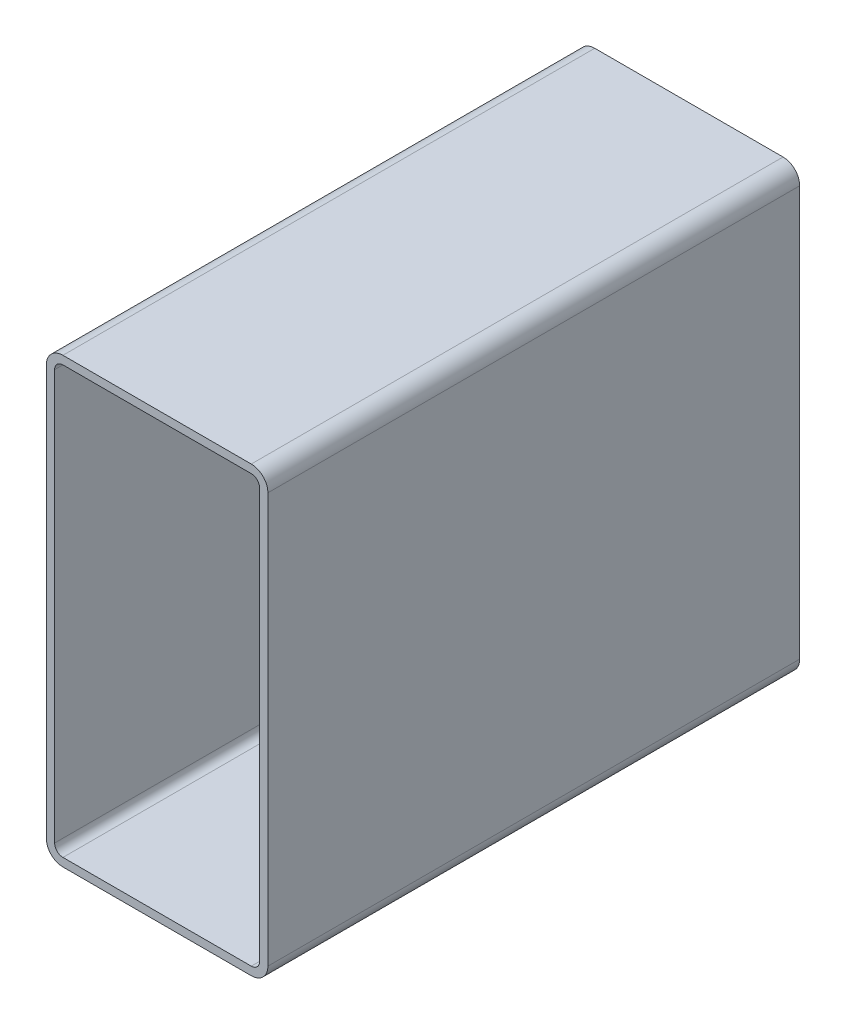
ISO-10303-21;
HEADER;
FILE_DESCRIPTION(('STEP AP214'),'2;1');
FILE_NAME('part.step','',(''),(''),'','','');
FILE_SCHEMA(('AUTOMOTIVE_DESIGN { 1 0 10303 214 1 1 1 1 }'));
ENDSEC;
DATA;
#1=APPLICATION_CONTEXT('core data for automotive mechanical design processes');
#2=APPLICATION_PROTOCOL_DEFINITION('international standard','automotive_design',2000,#1);
#3=PRODUCT_CONTEXT('',#1,'mechanical');
#4=PRODUCT('Part','Part','',(#3));
#5=PRODUCT_RELATED_PRODUCT_CATEGORY('part','',(#4));
#6=PRODUCT_DEFINITION_FORMATION('','',#4);
#7=PRODUCT_DEFINITION_CONTEXT('part definition',#1,'design');
#8=PRODUCT_DEFINITION('design','',#6,#7);
#9=PRODUCT_DEFINITION_SHAPE('','',#8);
#10=(LENGTH_UNIT() NAMED_UNIT(*) SI_UNIT(.MILLI.,.METRE.));
#11=(NAMED_UNIT(*) PLANE_ANGLE_UNIT() SI_UNIT($,.RADIAN.));
#12=(NAMED_UNIT(*) SI_UNIT($,.STERADIAN.) SOLID_ANGLE_UNIT());
#13=UNCERTAINTY_MEASURE_WITH_UNIT(LENGTH_MEASURE(1.E-05),#10,'distance_accuracy_value','');
#14=(GEOMETRIC_REPRESENTATION_CONTEXT(3) GLOBAL_UNCERTAINTY_ASSIGNED_CONTEXT((#13)) GLOBAL_UNIT_ASSIGNED_CONTEXT((#10,
#11,#12)) REPRESENTATION_CONTEXT('',''));
#15=CARTESIAN_POINT('',(0.,0.,0.));
#16=DIRECTION('',(0.,0.,1.));
#17=DIRECTION('',(1.,0.,0.));
#18=AXIS2_PLACEMENT_3D('',#15,#16,#17);
#19=CARTESIAN_POINT('',(10.3862396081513,246.395313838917,304.8));
#20=DIRECTION('',(0.,0.,1.));
#21=DIRECTION('',(1.,0.,0.));
#22=AXIS2_PLACEMENT_3D('',#19,#20,#21);
#23=PLANE('',#22);
#24=CARTESIAN_POINT('',(10.3862396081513,246.395313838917,304.8));
#25=DIRECTION('',(0.,0.,1.));
#26=DIRECTION('',(1.,0.,0.));
#27=AXIS2_PLACEMENT_3D('',#24,#25,#26);
#28=CIRCLE('',#27,9.52500000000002);
#29=CARTESIAN_POINT('',(10.3862396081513,255.920313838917,304.8));
#30=VERTEX_POINT('',#29);
#31=CARTESIAN_POINT('',(0.8612396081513,246.395313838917,304.8));
#32=VERTEX_POINT('',#31);
#33=EDGE_CURVE('E211',#30,#32,#28,.T.);
#34=ORIENTED_EDGE('',*,*,#33,.T.);
#35=DIRECTION('',(0.,-1.,0.));
#36=VECTOR('',#35,1.);
#37=CARTESIAN_POINT('',(0.8612396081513,11.4453138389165,304.8));
#38=LINE('',#37,#36);
#39=CARTESIAN_POINT('',(0.861239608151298,11.4453138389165,304.8));
#40=VERTEX_POINT('',#39);
#41=EDGE_CURVE('E214',#32,#40,#38,.T.);
#42=ORIENTED_EDGE('',*,*,#41,.T.);
#43=CARTESIAN_POINT('',(10.3862396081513,11.4453138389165,304.8));
#44=DIRECTION('',(0.,0.,1.));
#45=DIRECTION('',(1.,0.,0.));
#46=AXIS2_PLACEMENT_3D('',#43,#44,#45);
#47=CIRCLE('',#46,9.525);
#48=CARTESIAN_POINT('',(10.3862396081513,1.92031383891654,304.8));
#49=VERTEX_POINT('',#48);
#50=EDGE_CURVE('E217',#40,#49,#47,.T.);
#51=ORIENTED_EDGE('',*,*,#50,.T.);
#52=DIRECTION('',(1.,0.,0.));
#53=VECTOR('',#52,1.);
#54=CARTESIAN_POINT('',(118.336239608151,1.92031383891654,304.8));
#55=LINE('',#54,#53);
#56=CARTESIAN_POINT('',(118.336239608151,1.92031383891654,304.8));
#57=VERTEX_POINT('',#56);
#58=EDGE_CURVE('E219',#49,#57,#55,.T.);
#59=ORIENTED_EDGE('',*,*,#58,.T.);
#60=CARTESIAN_POINT('',(118.336239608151,11.4453138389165,304.8));
#61=DIRECTION('',(0.,0.,1.));
#62=DIRECTION('',(1.,0.,0.));
#63=AXIS2_PLACEMENT_3D('',#60,#61,#62);
#64=CIRCLE('',#63,9.525);
#65=CARTESIAN_POINT('',(127.861239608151,11.4453138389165,304.8));
#66=VERTEX_POINT('',#65);
#67=EDGE_CURVE('E221',#57,#66,#64,.T.);
#68=ORIENTED_EDGE('',*,*,#67,.T.);
#69=DIRECTION('',(0.,1.,0.));
#70=VECTOR('',#69,1.);
#71=CARTESIAN_POINT('',(127.861239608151,246.395313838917,304.8));
#72=LINE('',#71,#70);
#73=CARTESIAN_POINT('',(127.861239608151,246.395313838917,304.8));
#74=VERTEX_POINT('',#73);
#75=EDGE_CURVE('E223',#66,#74,#72,.T.);
#76=ORIENTED_EDGE('',*,*,#75,.T.);
#77=CARTESIAN_POINT('',(118.336239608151,246.395313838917,304.8));
#78=DIRECTION('',(0.,0.,1.));
#79=DIRECTION('',(1.,0.,0.));
#80=AXIS2_PLACEMENT_3D('',#77,#78,#79);
#81=CIRCLE('',#80,9.52500000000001);
#82=CARTESIAN_POINT('',(118.336239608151,255.920313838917,304.8));
#83=VERTEX_POINT('',#82);
#84=EDGE_CURVE('E225',#74,#83,#81,.T.);
#85=ORIENTED_EDGE('',*,*,#84,.T.);
#86=DIRECTION('',(-1.,0.,0.));
#87=VECTOR('',#86,1.);
#88=CARTESIAN_POINT('',(10.3862396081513,255.920313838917,304.8));
#89=LINE('',#88,#87);
#90=EDGE_CURVE('E227',#83,#30,#89,.T.);
#91=ORIENTED_EDGE('',*,*,#90,.T.);
#92=EDGE_LOOP('',(#34,#42,#51,#59,#68,#76,#85,#91));
#93=FACE_BOUND('',#92,.T.);
#94=DIRECTION('',(0.,-1.,0.));
#95=VECTOR('',#94,1.);
#96=CARTESIAN_POINT('',(5.6237396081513,11.4453138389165,304.8));
#97=LINE('',#96,#95);
#98=CARTESIAN_POINT('',(5.6237396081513,246.395313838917,304.8));
#99=VERTEX_POINT('',#98);
#100=CARTESIAN_POINT('',(5.6237396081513,11.4453138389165,304.8));
#101=VERTEX_POINT('',#100);
#102=EDGE_CURVE('E154',#99,#101,#97,.T.);
#103=ORIENTED_EDGE('',*,*,#102,.F.);
#104=CARTESIAN_POINT('',(10.3862396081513,246.395313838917,304.8));
#105=DIRECTION('',(0.,0.,1.));
#106=DIRECTION('',(1.,0.,0.));
#107=AXIS2_PLACEMENT_3D('',#104,#105,#106);
#108=CIRCLE('',#107,4.76250000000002);
#109=CARTESIAN_POINT('',(10.3862396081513,251.157813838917,304.8));
#110=VERTEX_POINT('',#109);
#111=EDGE_CURVE('E146',#110,#99,#108,.T.);
#112=ORIENTED_EDGE('',*,*,#111,.F.);
#113=DIRECTION('',(-1.,0.,0.));
#114=VECTOR('',#113,1.);
#115=CARTESIAN_POINT('',(10.3862396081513,251.157813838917,304.8));
#116=LINE('',#115,#114);
#117=CARTESIAN_POINT('',(118.336239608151,251.157813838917,304.8));
#118=VERTEX_POINT('',#117);
#119=EDGE_CURVE('E179',#118,#110,#116,.T.);
#120=ORIENTED_EDGE('',*,*,#119,.F.);
#121=CARTESIAN_POINT('',(118.336239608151,246.395313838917,304.8));
#122=DIRECTION('',(0.,0.,1.));
#123=DIRECTION('',(1.,0.,0.));
#124=AXIS2_PLACEMENT_3D('',#121,#122,#123);
#125=CIRCLE('',#124,4.76250000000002);
#126=CARTESIAN_POINT('',(123.098739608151,246.395313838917,304.8));
#127=VERTEX_POINT('',#126);
#128=EDGE_CURVE('E177',#127,#118,#125,.T.);
#129=ORIENTED_EDGE('',*,*,#128,.F.);
#130=DIRECTION('',(0.,1.,0.));
#131=VECTOR('',#130,1.);
#132=CARTESIAN_POINT('',(123.098739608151,246.395313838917,304.8));
#133=LINE('',#132,#131);
#134=CARTESIAN_POINT('',(123.098739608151,11.4453138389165,304.8));
#135=VERTEX_POINT('',#134);
#136=EDGE_CURVE('E175',#135,#127,#133,.T.);
#137=ORIENTED_EDGE('',*,*,#136,.F.);
#138=CARTESIAN_POINT('',(118.336239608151,11.4453138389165,304.8));
#139=DIRECTION('',(0.,0.,1.));
#140=DIRECTION('',(1.,0.,0.));
#141=AXIS2_PLACEMENT_3D('',#138,#139,#140);
#142=CIRCLE('',#141,4.7625);
#143=CARTESIAN_POINT('',(118.336239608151,6.68281383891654,304.8));
#144=VERTEX_POINT('',#143);
#145=EDGE_CURVE('E173',#144,#135,#142,.T.);
#146=ORIENTED_EDGE('',*,*,#145,.F.);
#147=DIRECTION('',(1.,0.,0.));
#148=VECTOR('',#147,1.);
#149=CARTESIAN_POINT('',(118.336239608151,6.68281383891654,304.8));
#150=LINE('',#149,#148);
#151=CARTESIAN_POINT('',(10.3862396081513,6.68281383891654,304.8));
#152=VERTEX_POINT('',#151);
#153=EDGE_CURVE('E169',#152,#144,#150,.T.);
#154=ORIENTED_EDGE('',*,*,#153,.F.);
#155=CARTESIAN_POINT('',(10.3862396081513,11.4453138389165,304.8));
#156=DIRECTION('',(0.,0.,1.));
#157=DIRECTION('',(1.,0.,0.));
#158=AXIS2_PLACEMENT_3D('',#155,#156,#157);
#159=CIRCLE('',#158,4.7625);
#160=EDGE_CURVE('E167',#101,#152,#159,.T.);
#161=ORIENTED_EDGE('',*,*,#160,.F.);
#162=EDGE_LOOP('',(#103,#112,#120,#129,#137,#146,#154,#161));
#163=FACE_BOUND('',#162,.T.);
#164=ADVANCED_FACE('F33',(#93,#163),#23,.T.);
#165=CARTESIAN_POINT('',(10.3862396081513,246.395313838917,0.));
#166=DIRECTION('',(0.,0.,1.));
#167=DIRECTION('',(1.,0.,0.));
#168=AXIS2_PLACEMENT_3D('',#165,#166,#167);
#169=PLANE('',#168);
#170=CARTESIAN_POINT('',(10.3862396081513,246.395313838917,0.));
#171=DIRECTION('',(0.,0.,1.));
#172=DIRECTION('',(1.,0.,0.));
#173=AXIS2_PLACEMENT_3D('',#170,#171,#172);
#174=CIRCLE('',#173,9.52500000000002);
#175=CARTESIAN_POINT('',(10.3862396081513,255.920313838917,0.));
#176=VERTEX_POINT('',#175);
#177=CARTESIAN_POINT('',(0.8612396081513,246.395313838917,0.));
#178=VERTEX_POINT('',#177);
#179=EDGE_CURVE('E162',#176,#178,#174,.T.);
#180=ORIENTED_EDGE('',*,*,#179,.F.);
#181=DIRECTION('',(-1.,0.,0.));
#182=VECTOR('',#181,1.);
#183=CARTESIAN_POINT('',(10.3862396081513,255.920313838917,0.));
#184=LINE('',#183,#182);
#185=CARTESIAN_POINT('',(118.336239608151,255.920313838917,0.));
#186=VERTEX_POINT('',#185);
#187=EDGE_CURVE('E215',#186,#176,#184,.T.);
#188=ORIENTED_EDGE('',*,*,#187,.F.);
#189=CARTESIAN_POINT('',(118.336239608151,246.395313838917,0.));
#190=DIRECTION('',(0.,0.,1.));
#191=DIRECTION('',(1.,0.,0.));
#192=AXIS2_PLACEMENT_3D('',#189,#190,#191);
#193=CIRCLE('',#192,9.52500000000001);
#194=CARTESIAN_POINT('',(127.861239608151,246.395313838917,0.));
#195=VERTEX_POINT('',#194);
#196=EDGE_CURVE('E242',#195,#186,#193,.T.);
#197=ORIENTED_EDGE('',*,*,#196,.F.);
#198=DIRECTION('',(0.,1.,0.));
#199=VECTOR('',#198,1.);
#200=CARTESIAN_POINT('',(127.861239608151,246.395313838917,0.));
#201=LINE('',#200,#199);
#202=CARTESIAN_POINT('',(127.861239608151,11.4453138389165,0.));
#203=VERTEX_POINT('',#202);
#204=EDGE_CURVE('E240',#203,#195,#201,.T.);
#205=ORIENTED_EDGE('',*,*,#204,.F.);
#206=CARTESIAN_POINT('',(118.336239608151,11.4453138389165,0.));
#207=DIRECTION('',(0.,0.,1.));
#208=DIRECTION('',(1.,0.,0.));
#209=AXIS2_PLACEMENT_3D('',#206,#207,#208);
#210=CIRCLE('',#209,9.525);
#211=CARTESIAN_POINT('',(118.336239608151,1.92031383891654,0.));
#212=VERTEX_POINT('',#211);
#213=EDGE_CURVE('E238',#212,#203,#210,.T.);
#214=ORIENTED_EDGE('',*,*,#213,.F.);
#215=DIRECTION('',(1.,0.,0.));
#216=VECTOR('',#215,1.);
#217=CARTESIAN_POINT('',(118.336239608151,1.92031383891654,0.));
#218=LINE('',#217,#216);
#219=CARTESIAN_POINT('',(10.3862396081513,1.92031383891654,0.));
#220=VERTEX_POINT('',#219);
#221=EDGE_CURVE('E236',#220,#212,#218,.T.);
#222=ORIENTED_EDGE('',*,*,#221,.F.);
#223=CARTESIAN_POINT('',(10.3862396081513,11.4453138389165,0.));
#224=DIRECTION('',(0.,0.,1.));
#225=DIRECTION('',(1.,0.,0.));
#226=AXIS2_PLACEMENT_3D('',#223,#224,#225);
#227=CIRCLE('',#226,9.525);
#228=CARTESIAN_POINT('',(0.861239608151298,11.4453138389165,0.));
#229=VERTEX_POINT('',#228);
#230=EDGE_CURVE('E234',#229,#220,#227,.T.);
#231=ORIENTED_EDGE('',*,*,#230,.F.);
#232=DIRECTION('',(0.,-1.,0.));
#233=VECTOR('',#232,1.);
#234=CARTESIAN_POINT('',(0.8612396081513,11.4453138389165,0.));
#235=LINE('',#234,#233);
#236=EDGE_CURVE('E232',#178,#229,#235,.T.);
#237=ORIENTED_EDGE('',*,*,#236,.F.);
#238=EDGE_LOOP('',(#180,#188,#197,#205,#214,#222,#231,#237));
#239=FACE_BOUND('',#238,.T.);
#240=CARTESIAN_POINT('',(10.3862396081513,246.395313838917,0.));
#241=DIRECTION('',(0.,0.,1.));
#242=DIRECTION('',(1.,0.,0.));
#243=AXIS2_PLACEMENT_3D('',#240,#241,#242);
#244=CIRCLE('',#243,4.76250000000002);
#245=CARTESIAN_POINT('',(10.3862396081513,251.157813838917,0.));
#246=VERTEX_POINT('',#245);
#247=CARTESIAN_POINT('',(5.6237396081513,246.395313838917,0.));
#248=VERTEX_POINT('',#247);
#249=EDGE_CURVE('E56',#246,#248,#244,.T.);
#250=ORIENTED_EDGE('',*,*,#249,.T.);
#251=DIRECTION('',(0.,-1.,0.));
#252=VECTOR('',#251,1.);
#253=CARTESIAN_POINT('',(5.6237396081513,11.4453138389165,0.));
#254=LINE('',#253,#252);
#255=CARTESIAN_POINT('',(5.6237396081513,11.4453138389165,0.));
#256=VERTEX_POINT('',#255);
#257=EDGE_CURVE('E161',#248,#256,#254,.T.);
#258=ORIENTED_EDGE('',*,*,#257,.T.);
#259=CARTESIAN_POINT('',(10.3862396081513,11.4453138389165,0.));
#260=DIRECTION('',(0.,0.,1.));
#261=DIRECTION('',(1.,0.,0.));
#262=AXIS2_PLACEMENT_3D('',#259,#260,#261);
#263=CIRCLE('',#262,4.7625);
#264=CARTESIAN_POINT('',(10.3862396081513,6.68281383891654,0.));
#265=VERTEX_POINT('',#264);
#266=EDGE_CURVE('E183',#256,#265,#263,.T.);
#267=ORIENTED_EDGE('',*,*,#266,.T.);
#268=DIRECTION('',(1.,0.,0.));
#269=VECTOR('',#268,1.);
#270=CARTESIAN_POINT('',(118.336239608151,6.68281383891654,0.));
#271=LINE('',#270,#269);
#272=CARTESIAN_POINT('',(118.336239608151,6.68281383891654,0.));
#273=VERTEX_POINT('',#272);
#274=EDGE_CURVE('E186',#265,#273,#271,.T.);
#275=ORIENTED_EDGE('',*,*,#274,.T.);
#276=CARTESIAN_POINT('',(118.336239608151,11.4453138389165,0.));
#277=DIRECTION('',(0.,0.,1.));
#278=DIRECTION('',(1.,0.,0.));
#279=AXIS2_PLACEMENT_3D('',#276,#277,#278);
#280=CIRCLE('',#279,4.7625);
#281=CARTESIAN_POINT('',(123.098739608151,11.4453138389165,0.));
#282=VERTEX_POINT('',#281);
#283=EDGE_CURVE('E189',#273,#282,#280,.T.);
#284=ORIENTED_EDGE('',*,*,#283,.T.);
#285=DIRECTION('',(0.,1.,0.));
#286=VECTOR('',#285,1.);
#287=CARTESIAN_POINT('',(123.098739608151,246.395313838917,0.));
#288=LINE('',#287,#286);
#289=CARTESIAN_POINT('',(123.098739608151,246.395313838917,0.));
#290=VERTEX_POINT('',#289);
#291=EDGE_CURVE('E192',#282,#290,#288,.T.);
#292=ORIENTED_EDGE('',*,*,#291,.T.);
#293=CARTESIAN_POINT('',(118.336239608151,246.395313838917,0.));
#294=DIRECTION('',(0.,0.,1.));
#295=DIRECTION('',(1.,0.,0.));
#296=AXIS2_PLACEMENT_3D('',#293,#294,#295);
#297=CIRCLE('',#296,4.76250000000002);
#298=CARTESIAN_POINT('',(118.336239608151,251.157813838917,0.));
#299=VERTEX_POINT('',#298);
#300=EDGE_CURVE('E195',#290,#299,#297,.T.);
#301=ORIENTED_EDGE('',*,*,#300,.T.);
#302=DIRECTION('',(-1.,0.,0.));
#303=VECTOR('',#302,1.);
#304=CARTESIAN_POINT('',(10.3862396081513,251.157813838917,0.));
#305=LINE('',#304,#303);
#306=EDGE_CURVE('E155',#299,#246,#305,.T.);
#307=ORIENTED_EDGE('',*,*,#306,.T.);
#308=EDGE_LOOP('',(#250,#258,#267,#275,#284,#292,#301,#307));
#309=FACE_BOUND('',#308,.T.);
#310=ADVANCED_FACE('F272',(#239,#309),#169,.F.);
#311=CARTESIAN_POINT('',(10.3862396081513,246.395313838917,304.8));
#312=DIRECTION('',(0.,0.,-1.));
#313=DIRECTION('',(-1.,0.,0.));
#314=AXIS2_PLACEMENT_3D('',#311,#312,#313);
#315=CYLINDRICAL_SURFACE('',#314,9.52500000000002);
#316=ORIENTED_EDGE('',*,*,#179,.T.);
#317=DIRECTION('',(0.,0.,-1.));
#318=VECTOR('',#317,1.);
#319=CARTESIAN_POINT('',(0.8612396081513,246.395313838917,304.8));
#320=LINE('',#319,#318);
#321=EDGE_CURVE('E11',#32,#178,#320,.T.);
#322=ORIENTED_EDGE('',*,*,#321,.F.);
#323=ORIENTED_EDGE('',*,*,#33,.F.);
#324=DIRECTION('',(0.,0.,-1.));
#325=VECTOR('',#324,1.);
#326=CARTESIAN_POINT('',(10.3862396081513,255.920313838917,304.8));
#327=LINE('',#326,#325);
#328=EDGE_CURVE('E229',#30,#176,#327,.T.);
#329=ORIENTED_EDGE('',*,*,#328,.T.);
#330=EDGE_LOOP('',(#316,#322,#323,#329));
#331=FACE_BOUND('',#330,.T.);
#332=ADVANCED_FACE('F35',(#331),#315,.T.);
#333=CARTESIAN_POINT('',(0.8612396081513,11.4453138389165,304.8));
#334=DIRECTION('',(1.,0.,0.));
#335=DIRECTION('',(0.,0.,-1.));
#336=AXIS2_PLACEMENT_3D('',#333,#334,#335);
#337=PLANE('',#336);
#338=ORIENTED_EDGE('',*,*,#236,.T.);
#339=DIRECTION('',(0.,0.,-1.));
#340=VECTOR('',#339,1.);
#341=CARTESIAN_POINT('',(0.861239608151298,11.4453138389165,304.8));
#342=LINE('',#341,#340);
#343=EDGE_CURVE('E41',#40,#229,#342,.T.);
#344=ORIENTED_EDGE('',*,*,#343,.F.);
#345=ORIENTED_EDGE('',*,*,#41,.F.);
#346=ORIENTED_EDGE('',*,*,#321,.T.);
#347=EDGE_LOOP('',(#338,#344,#345,#346));
#348=FACE_BOUND('',#347,.T.);
#349=ADVANCED_FACE('F289',(#348),#337,.F.);
#350=CARTESIAN_POINT('',(10.3862396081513,11.4453138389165,304.8));
#351=DIRECTION('',(0.,0.,-1.));
#352=DIRECTION('',(-1.,0.,0.));
#353=AXIS2_PLACEMENT_3D('',#350,#351,#352);
#354=CYLINDRICAL_SURFACE('',#353,9.525);
#355=ORIENTED_EDGE('',*,*,#230,.T.);
#356=DIRECTION('',(0.,0.,-1.));
#357=VECTOR('',#356,1.);
#358=CARTESIAN_POINT('',(10.3862396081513,1.92031383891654,304.8));
#359=LINE('',#358,#357);
#360=EDGE_CURVE('E259',#49,#220,#359,.T.);
#361=ORIENTED_EDGE('',*,*,#360,.F.);
#362=ORIENTED_EDGE('',*,*,#50,.F.);
#363=ORIENTED_EDGE('',*,*,#343,.T.);
#364=EDGE_LOOP('',(#355,#361,#362,#363));
#365=FACE_BOUND('',#364,.T.);
#366=ADVANCED_FACE('F266',(#365),#354,.T.);
#367=CARTESIAN_POINT('',(118.336239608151,1.92031383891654,304.8));
#368=DIRECTION('',(0.,1.,0.));
#369=DIRECTION('',(0.,0.,1.));
#370=AXIS2_PLACEMENT_3D('',#367,#368,#369);
#371=PLANE('',#370);
#372=ORIENTED_EDGE('',*,*,#221,.T.);
#373=DIRECTION('',(0.,0.,-1.));
#374=VECTOR('',#373,1.);
#375=CARTESIAN_POINT('',(118.336239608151,1.92031383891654,304.8));
#376=LINE('',#375,#374);
#377=EDGE_CURVE('E256',#57,#212,#376,.T.);
#378=ORIENTED_EDGE('',*,*,#377,.F.);
#379=ORIENTED_EDGE('',*,*,#58,.F.);
#380=ORIENTED_EDGE('',*,*,#360,.T.);
#381=EDGE_LOOP('',(#372,#378,#379,#380));
#382=FACE_BOUND('',#381,.T.);
#383=ADVANCED_FACE('F278',(#382),#371,.F.);
#384=CARTESIAN_POINT('',(118.336239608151,11.4453138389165,304.8));
#385=DIRECTION('',(0.,0.,-1.));
#386=DIRECTION('',(-1.,0.,0.));
#387=AXIS2_PLACEMENT_3D('',#384,#385,#386);
#388=CYLINDRICAL_SURFACE('',#387,9.525);
#389=ORIENTED_EDGE('',*,*,#213,.T.);
#390=DIRECTION('',(0.,0.,-1.));
#391=VECTOR('',#390,1.);
#392=CARTESIAN_POINT('',(127.861239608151,11.4453138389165,304.8));
#393=LINE('',#392,#391);
#394=EDGE_CURVE('E253',#66,#203,#393,.T.);
#395=ORIENTED_EDGE('',*,*,#394,.F.);
#396=ORIENTED_EDGE('',*,*,#67,.F.);
#397=ORIENTED_EDGE('',*,*,#377,.T.);
#398=EDGE_LOOP('',(#389,#395,#396,#397));
#399=FACE_BOUND('',#398,.T.);
#400=ADVANCED_FACE('F282',(#399),#388,.T.);
#401=CARTESIAN_POINT('',(127.861239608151,246.395313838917,304.8));
#402=DIRECTION('',(-1.,0.,0.));
#403=DIRECTION('',(0.,0.,1.));
#404=AXIS2_PLACEMENT_3D('',#401,#402,#403);
#405=PLANE('',#404);
#406=ORIENTED_EDGE('',*,*,#204,.T.);
#407=DIRECTION('',(0.,0.,-1.));
#408=VECTOR('',#407,1.);
#409=CARTESIAN_POINT('',(127.861239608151,246.395313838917,304.8));
#410=LINE('',#409,#408);
#411=EDGE_CURVE('E250',#74,#195,#410,.T.);
#412=ORIENTED_EDGE('',*,*,#411,.F.);
#413=ORIENTED_EDGE('',*,*,#75,.F.);
#414=ORIENTED_EDGE('',*,*,#394,.T.);
#415=EDGE_LOOP('',(#406,#412,#413,#414));
#416=FACE_BOUND('',#415,.T.);
#417=ADVANCED_FACE('F302',(#416),#405,.F.);
#418=CARTESIAN_POINT('',(118.336239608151,246.395313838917,304.8));
#419=DIRECTION('',(0.,0.,-1.));
#420=DIRECTION('',(-1.,0.,0.));
#421=AXIS2_PLACEMENT_3D('',#418,#419,#420);
#422=CYLINDRICAL_SURFACE('',#421,9.52500000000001);
#423=ORIENTED_EDGE('',*,*,#196,.T.);
#424=DIRECTION('',(0.,0.,-1.));
#425=VECTOR('',#424,1.);
#426=CARTESIAN_POINT('',(118.336239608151,255.920313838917,304.8));
#427=LINE('',#426,#425);
#428=EDGE_CURVE('E247',#83,#186,#427,.T.);
#429=ORIENTED_EDGE('',*,*,#428,.F.);
#430=ORIENTED_EDGE('',*,*,#84,.F.);
#431=ORIENTED_EDGE('',*,*,#411,.T.);
#432=EDGE_LOOP('',(#423,#429,#430,#431));
#433=FACE_BOUND('',#432,.T.);
#434=ADVANCED_FACE('F300',(#433),#422,.T.);
#435=CARTESIAN_POINT('',(10.3862396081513,255.920313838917,304.8));
#436=DIRECTION('',(0.,-1.,0.));
#437=DIRECTION('',(0.,0.,-1.));
#438=AXIS2_PLACEMENT_3D('',#435,#436,#437);
#439=PLANE('',#438);
#440=ORIENTED_EDGE('',*,*,#187,.T.);
#441=ORIENTED_EDGE('',*,*,#328,.F.);
#442=ORIENTED_EDGE('',*,*,#90,.F.);
#443=ORIENTED_EDGE('',*,*,#428,.T.);
#444=EDGE_LOOP('',(#440,#441,#442,#443));
#445=FACE_BOUND('',#444,.T.);
#446=ADVANCED_FACE('F295',(#445),#439,.F.);
#447=CARTESIAN_POINT('',(10.3862396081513,246.395313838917,304.8));
#448=DIRECTION('',(0.,0.,-1.));
#449=DIRECTION('',(-1.,0.,0.));
#450=AXIS2_PLACEMENT_3D('',#447,#448,#449);
#451=CYLINDRICAL_SURFACE('',#450,4.76250000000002);
#452=ORIENTED_EDGE('',*,*,#249,.F.);
#453=DIRECTION('',(0.,0.,-1.));
#454=VECTOR('',#453,1.);
#455=CARTESIAN_POINT('',(10.3862396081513,251.157813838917,304.8));
#456=LINE('',#455,#454);
#457=EDGE_CURVE('E150',#110,#246,#456,.T.);
#458=ORIENTED_EDGE('',*,*,#457,.F.);
#459=ORIENTED_EDGE('',*,*,#111,.T.);
#460=DIRECTION('',(0.,0.,-1.));
#461=VECTOR('',#460,1.);
#462=CARTESIAN_POINT('',(5.6237396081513,246.395313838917,304.8));
#463=LINE('',#462,#461);
#464=EDGE_CURVE('E149',#99,#248,#463,.T.);
#465=ORIENTED_EDGE('',*,*,#464,.T.);
#466=EDGE_LOOP('',(#452,#458,#459,#465));
#467=FACE_BOUND('',#466,.T.);
#468=ADVANCED_FACE('F148',(#467),#451,.F.);
#469=CARTESIAN_POINT('',(5.6237396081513,11.4453138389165,304.8));
#470=DIRECTION('',(1.,0.,0.));
#471=DIRECTION('',(0.,0.,-1.));
#472=AXIS2_PLACEMENT_3D('',#469,#470,#471);
#473=PLANE('',#472);
#474=ORIENTED_EDGE('',*,*,#257,.F.);
#475=ORIENTED_EDGE('',*,*,#464,.F.);
#476=ORIENTED_EDGE('',*,*,#102,.T.);
#477=DIRECTION('',(0.,0.,-1.));
#478=VECTOR('',#477,1.);
#479=CARTESIAN_POINT('',(5.6237396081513,11.4453138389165,304.8));
#480=LINE('',#479,#478);
#481=EDGE_CURVE('E163',#101,#256,#480,.T.);
#482=ORIENTED_EDGE('',*,*,#481,.T.);
#483=EDGE_LOOP('',(#474,#475,#476,#482));
#484=FACE_BOUND('',#483,.T.);
#485=ADVANCED_FACE('F158',(#484),#473,.T.);
#486=CARTESIAN_POINT('',(10.3862396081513,11.4453138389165,304.8));
#487=DIRECTION('',(0.,0.,-1.));
#488=DIRECTION('',(-1.,0.,0.));
#489=AXIS2_PLACEMENT_3D('',#486,#487,#488);
#490=CYLINDRICAL_SURFACE('',#489,4.7625);
#491=ORIENTED_EDGE('',*,*,#266,.F.);
#492=ORIENTED_EDGE('',*,*,#481,.F.);
#493=ORIENTED_EDGE('',*,*,#160,.T.);
#494=DIRECTION('',(0.,0.,-1.));
#495=VECTOR('',#494,1.);
#496=CARTESIAN_POINT('',(10.3862396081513,6.68281383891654,304.8));
#497=LINE('',#496,#495);
#498=EDGE_CURVE('E208',#152,#265,#497,.T.);
#499=ORIENTED_EDGE('',*,*,#498,.T.);
#500=EDGE_LOOP('',(#491,#492,#493,#499));
#501=FACE_BOUND('',#500,.T.);
#502=ADVANCED_FACE('F327',(#501),#490,.F.);
#503=CARTESIAN_POINT('',(118.336239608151,6.68281383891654,304.8));
#504=DIRECTION('',(0.,1.,0.));
#505=DIRECTION('',(0.,0.,1.));
#506=AXIS2_PLACEMENT_3D('',#503,#504,#505);
#507=PLANE('',#506);
#508=ORIENTED_EDGE('',*,*,#274,.F.);
#509=ORIENTED_EDGE('',*,*,#498,.F.);
#510=ORIENTED_EDGE('',*,*,#153,.T.);
#511=DIRECTION('',(0.,0.,-1.));
#512=VECTOR('',#511,1.);
#513=CARTESIAN_POINT('',(118.336239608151,6.68281383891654,304.8));
#514=LINE('',#513,#512);
#515=EDGE_CURVE('E206',#144,#273,#514,.T.);
#516=ORIENTED_EDGE('',*,*,#515,.T.);
#517=EDGE_LOOP('',(#508,#509,#510,#516));
#518=FACE_BOUND('',#517,.T.);
#519=ADVANCED_FACE('F331',(#518),#507,.T.);
#520=CARTESIAN_POINT('',(118.336239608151,11.4453138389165,304.8));
#521=DIRECTION('',(0.,0.,-1.));
#522=DIRECTION('',(-1.,0.,0.));
#523=AXIS2_PLACEMENT_3D('',#520,#521,#522);
#524=CYLINDRICAL_SURFACE('',#523,4.7625);
#525=ORIENTED_EDGE('',*,*,#283,.F.);
#526=ORIENTED_EDGE('',*,*,#515,.F.);
#527=ORIENTED_EDGE('',*,*,#145,.T.);
#528=DIRECTION('',(0.,0.,-1.));
#529=VECTOR('',#528,1.);
#530=CARTESIAN_POINT('',(123.098739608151,11.4453138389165,304.8));
#531=LINE('',#530,#529);
#532=EDGE_CURVE('E204',#135,#282,#531,.T.);
#533=ORIENTED_EDGE('',*,*,#532,.T.);
#534=EDGE_LOOP('',(#525,#526,#527,#533));
#535=FACE_BOUND('',#534,.T.);
#536=ADVANCED_FACE('F337',(#535),#524,.F.);
#537=CARTESIAN_POINT('',(123.098739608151,246.395313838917,304.8));
#538=DIRECTION('',(-1.,0.,0.));
#539=DIRECTION('',(0.,0.,1.));
#540=AXIS2_PLACEMENT_3D('',#537,#538,#539);
#541=PLANE('',#540);
#542=ORIENTED_EDGE('',*,*,#291,.F.);
#543=ORIENTED_EDGE('',*,*,#532,.F.);
#544=ORIENTED_EDGE('',*,*,#136,.T.);
#545=DIRECTION('',(0.,0.,-1.));
#546=VECTOR('',#545,1.);
#547=CARTESIAN_POINT('',(123.098739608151,246.395313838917,304.8));
#548=LINE('',#547,#546);
#549=EDGE_CURVE('E202',#127,#290,#548,.T.);
#550=ORIENTED_EDGE('',*,*,#549,.T.);
#551=EDGE_LOOP('',(#542,#543,#544,#550));
#552=FACE_BOUND('',#551,.T.);
#553=ADVANCED_FACE('F341',(#552),#541,.T.);
#554=CARTESIAN_POINT('',(118.336239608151,246.395313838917,304.8));
#555=DIRECTION('',(0.,0.,-1.));
#556=DIRECTION('',(-1.,0.,0.));
#557=AXIS2_PLACEMENT_3D('',#554,#555,#556);
#558=CYLINDRICAL_SURFACE('',#557,4.76250000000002);
#559=ORIENTED_EDGE('',*,*,#300,.F.);
#560=ORIENTED_EDGE('',*,*,#549,.F.);
#561=ORIENTED_EDGE('',*,*,#128,.T.);
#562=DIRECTION('',(0.,0.,-1.));
#563=VECTOR('',#562,1.);
#564=CARTESIAN_POINT('',(118.336239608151,251.157813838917,304.8));
#565=LINE('',#564,#563);
#566=EDGE_CURVE('E48',#118,#299,#565,.T.);
#567=ORIENTED_EDGE('',*,*,#566,.T.);
#568=EDGE_LOOP('',(#559,#560,#561,#567));
#569=FACE_BOUND('',#568,.T.);
#570=ADVANCED_FACE('F345',(#569),#558,.F.);
#571=CARTESIAN_POINT('',(10.3862396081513,251.157813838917,304.8));
#572=DIRECTION('',(0.,-1.,0.));
#573=DIRECTION('',(0.,0.,-1.));
#574=AXIS2_PLACEMENT_3D('',#571,#572,#573);
#575=PLANE('',#574);
#576=ORIENTED_EDGE('',*,*,#306,.F.);
#577=ORIENTED_EDGE('',*,*,#566,.F.);
#578=ORIENTED_EDGE('',*,*,#119,.T.);
#579=ORIENTED_EDGE('',*,*,#457,.T.);
#580=EDGE_LOOP('',(#576,#577,#578,#579));
#581=FACE_BOUND('',#580,.T.);
#582=ADVANCED_FACE('F349',(#581),#575,.T.);
#583=CLOSED_SHELL('',(#164,#310,#332,#349,#366,#383,#400,#417,#434,#446,#468,#485,#502,#519,
#536,#553,#570,#582));
#584=MANIFOLD_SOLID_BREP('B2',#583);
#585=ADVANCED_BREP_SHAPE_REPRESENTATION('',(#18,#584),#14);
#586=SHAPE_DEFINITION_REPRESENTATION(#9,#585);
ENDSEC;
END-ISO-10303-21;
